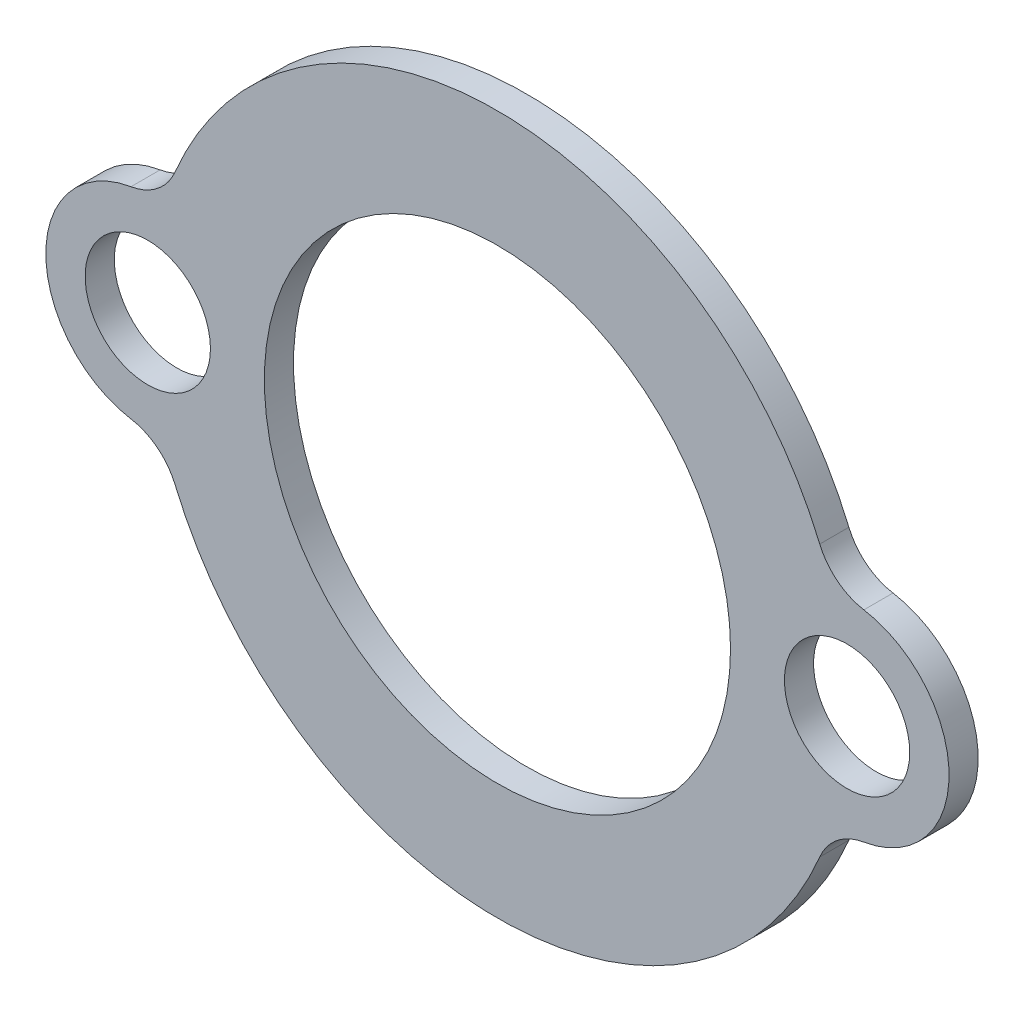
from build123d import *

# Parameters (mm, degrees)
ESQUISSE1_R        = 8
ESQUISSE1_R_2      = 2.15
BOSS_EXTRU_1_DEPTH = 1
CONG_1_R           = 2


with BuildPart() as part:
    # Esquisse1 → Boss.-Extru.1 (new body)
    with BuildSketch(Plane.XY):
        with BuildLine():
            ThreePointArc((-11.489583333, -3.462582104), (0, -12), (11.489583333, -3.462582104))
            ThreePointArc((11.489583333, -3.462582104), (15.5, 0), (11.489583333, 3.462582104))
            ThreePointArc((11.489583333, 3.462582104), (0, 12), (-11.489583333, 3.462582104))
            ThreePointArc((-11.489583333, 3.462582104), (-15.5, 0), (-11.489583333, -3.462582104))
        make_face()
        Circle(ESQUISSE1_R, mode=Mode.SUBTRACT)
        with Locations((12, 0)):
            Circle(ESQUISSE1_R_2, mode=Mode.SUBTRACT)
        with Locations((-12, 0)):
            Circle(ESQUISSE1_R_2, mode=Mode.SUBTRACT)
    extrude(amount=BOSS_EXTRU_1_DEPTH)

    # Cong_1
    cong_1_edges = [part.edges().sort_by_distance(p)[0] for p in [
        (11.489583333, 3.462582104, 0.5),
        (11.489583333, -3.462582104, 0.5),
        (-11.489583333, -3.462582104, 0.5),
        (-11.489583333, 3.462582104, 0.5),
    ]]
    fillet(cong_1_edges, radius=CONG_1_R)


solid = part.part
